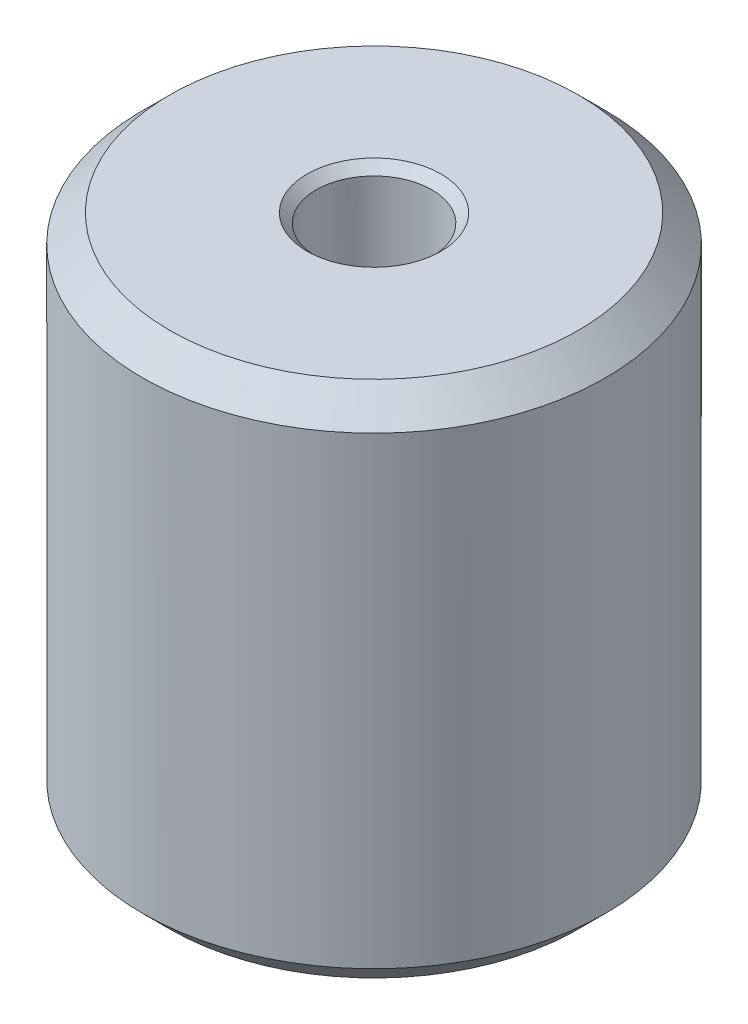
from build123d import *

# Parameters (mm, degrees)
CHAMFER1_SIZE    = 0.75
CHAMFER2_SIZE    = 0.25
SKETCH2_R        = 1.0922
SKETCH2_R_2      = 1.7272
EXTRUDE1_DEPTH   = 17.821628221
SKETCH3_R        = 1.0922
EXTRUDE2_DEPTH   = 2.54
SKETCH3_R_2      = 1.7272
EXTRUDE2_2_DEPTH = 2.54
EXTRUDE3_DEPTH   = 1


with BuildPart() as part:
    # Sketch1 → Revolve1 (revolve)
    with BuildSketch(Plane.XY, mode=Mode.PRIVATE) as revolve1_sk:
        Polygon((-3.175, 0), (-3.175, 6.985), (-1.5875, 6.985), (-1.5875, 14.224), (-6.35, 14.224), (-6.35, 0), align=None)
    revolve(revolve1_sk.sketch.rotate(Axis((0, 0, 0), (0, 1, 0)), 270), axis=Axis((0, 0, 0), (0, 1, 0)))

    # Chamfer1
    chamfer1_edges = [part.edges().sort_by_distance(p)[0] for p in [
        (0, 0, 6.35),
        (0, 14.224, 6.35),
    ]]
    chamfer(chamfer1_edges, length=CHAMFER1_SIZE)

    # Chamfer2
    chamfer2_edges = [part.edges().sort_by_distance(p)[0] for p in [
        (0, 14.224, 1.5875),
        (0, 0, 3.175),
    ]]
    chamfer(chamfer2_edges, length=CHAMFER2_SIZE)

    # Sketch2 → Extrude1 (cut, through all)
    with BuildSketch(Plane(origin=(0, 0, 0), x_dir=(0, 0, -1), z_dir=(1, 0, 0))):
        with Locations((0, 10.668)):
            Circle(SKETCH2_R)
        with Locations((0, 3.56)):
            Circle(SKETCH2_R_2)
    extrude(amount=-EXTRUDE1_DEPTH, mode=Mode.SUBTRACT)


with BuildPart() as body_2:
    # Sketch3 → Extrude2 (new body)
    with BuildSketch(Plane(origin=(-6.35, 0, 0), x_dir=(0, 0, -1), z_dir=(1, 0, 0))):
        with Locations((0, 10.668)):
            Circle(SKETCH3_R)
    extrude(amount=EXTRUDE2_DEPTH)


with BuildPart() as body_3:
    # Sketch3 → Extrude2 2 (new body)
    with BuildSketch(Plane(origin=(-6.35, 0, 0), x_dir=(0, 0, -1), z_dir=(1, 0, 0))):
        with Locations((0, 3.56)):
            Circle(SKETCH3_R_2)
    extrude(amount=EXTRUDE2_2_DEPTH)


with BuildPart() as extrude3_tool:
    # Sketch4 → Extrude3 (new body)
    with BuildSketch(Plane.ZY.offset(6.35)):
        Polygon((0.22225, 11.052948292), (-0.22225, 11.052948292), (-0.4445, 10.668), (-0.22225, 10.283051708), (0.22225, 10.283051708), (0.4445, 10.668), align=None)
        Polygon((0.396875, 4.247407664), (-0.396875, 4.247407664), (-0.79375, 3.56), (-0.396875, 2.872592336), (0.396875, 2.872592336), (0.79375, 3.56), align=None)
    extrude(amount=-EXTRUDE3_DEPTH)


with BuildPart() as body_2_1:
    add(body_2.part)

    # Extrude3: cut by extrude3_tool
    add(extrude3_tool.part, mode=Mode.SUBTRACT)


with BuildPart() as body_3_1:
    add(body_3.part)

    # Extrude3: cut by extrude3_tool
    add(extrude3_tool.part, mode=Mode.SUBTRACT)


solid = Compound([part.part, body_2_1.part, body_3_1.part])
